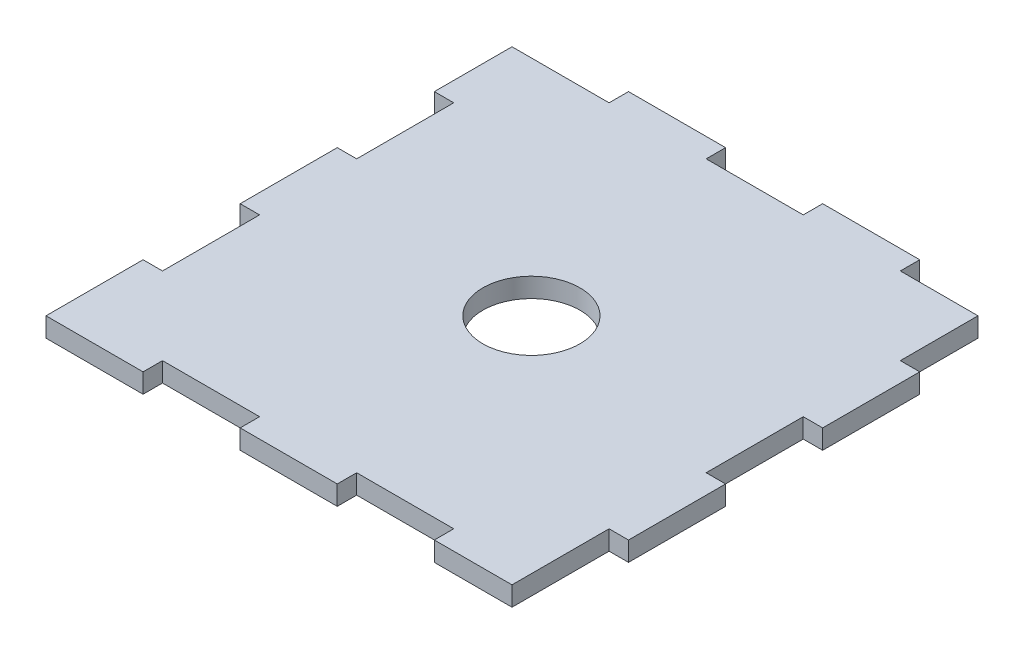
from build123d import *

# Parameters (mm, degrees)
SKETCH2_R           = 10
BOSS_EXTRUDE1_DEPTH = 4


with BuildPart() as part:
    # Sketch2 → Boss-Extrude1 (new body)
    with BuildSketch(Plane(origin=(0, 0, 0), x_dir=(1, 0, 0), z_dir=(0, 1, 0))):
        Polygon((-50, 46), (-30, 46), (-30, 50), (-10, 50), (-10, 46), (10, 46), (10, 50), (30, 50), (30, 46), (46, 46), (46, 30), (50, 30), (50, 10), (46, 10), (46, -10), (50, -10), (50, -30), (46, -30), (46, -50), (30, -50), (30, -46), (10, -46), (10, -50), (-10, -50), (-10, -46), (-30, -46), (-30, -50), (-50, -50), (-50, -30), (-46, -30), (-46, -10), (-50, -10), (-50, 10), (-46, 10), (-46, 30), (-50, 30), align=None)
        with Locations(Location((0, 0, 0), (0, 0, 270))):
            Circle(SKETCH2_R, mode=Mode.SUBTRACT)
    extrude(amount=BOSS_EXTRUDE1_DEPTH)


solid = part.part
